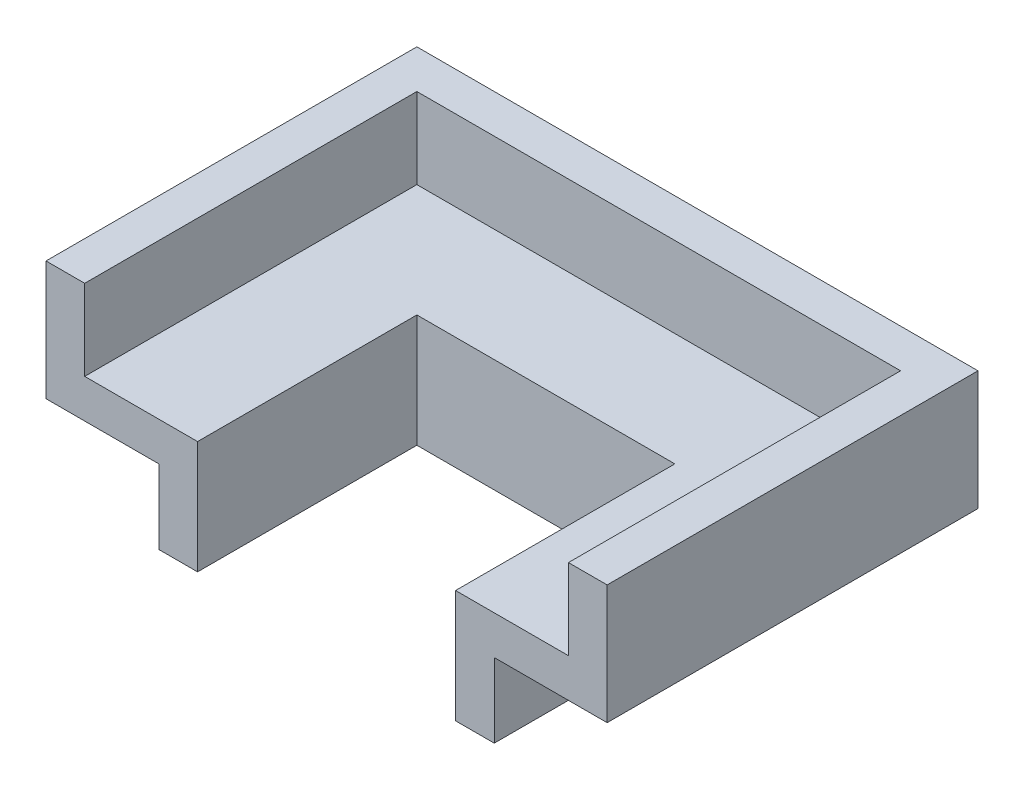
from build123d import *


with BuildPart() as part:
    # Sweep1: sweep along a path in Sketch2
    with BuildLine(Plane(origin=(0, 0, 0), x_dir=(1, 0, 0), z_dir=(0, 1, 0))) as sweep1_path:
        Line((-40, 0), (-40, 68))
        Line((-40, 68), (40, 68))
        Line((40, 68), (40, 0))
    # Sketch3 → Sweep1 (sweep)
    with BuildSketch(Plane.XY):
        Polygon((40, 0), (40, 35), (75, 35), (75, 60), (87, 60), (87, 23), (52, 23), (52, 0), align=None)
    sweep(path=sweep1_path.line, transition=Transition.RIGHT)


solid = part.part
